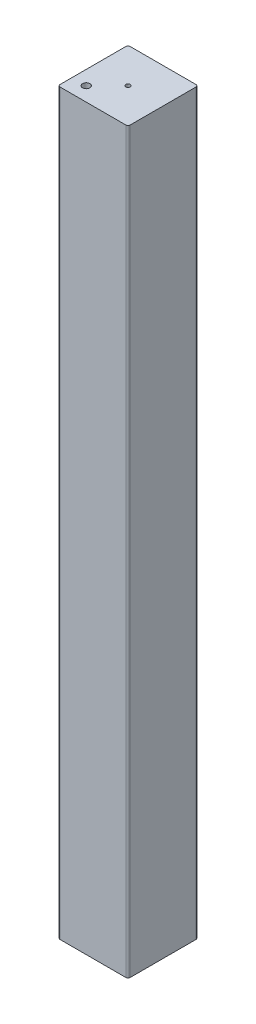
ISO-10303-21;
HEADER;
FILE_DESCRIPTION(('STEP AP214'),'2;1');
FILE_NAME('part.step','',(''),(''),'','','');
FILE_SCHEMA(('AUTOMOTIVE_DESIGN { 1 0 10303 214 1 1 1 1 }'));
ENDSEC;
DATA;
#1=APPLICATION_CONTEXT('core data for automotive mechanical design processes');
#2=APPLICATION_PROTOCOL_DEFINITION('international standard','automotive_design',2000,#1);
#3=PRODUCT_CONTEXT('',#1,'mechanical');
#4=PRODUCT('Part','Part','',(#3));
#5=PRODUCT_RELATED_PRODUCT_CATEGORY('part','',(#4));
#6=PRODUCT_DEFINITION_FORMATION('','',#4);
#7=PRODUCT_DEFINITION_CONTEXT('part definition',#1,'design');
#8=PRODUCT_DEFINITION('design','',#6,#7);
#9=PRODUCT_DEFINITION_SHAPE('','',#8);
#10=(LENGTH_UNIT() NAMED_UNIT(*) SI_UNIT(.MILLI.,.METRE.));
#11=(NAMED_UNIT(*) PLANE_ANGLE_UNIT() SI_UNIT($,.RADIAN.));
#12=(NAMED_UNIT(*) SI_UNIT($,.STERADIAN.) SOLID_ANGLE_UNIT());
#13=UNCERTAINTY_MEASURE_WITH_UNIT(LENGTH_MEASURE(1.E-05),#10,'distance_accuracy_value','');
#14=(GEOMETRIC_REPRESENTATION_CONTEXT(3) GLOBAL_UNCERTAINTY_ASSIGNED_CONTEXT((#13)) GLOBAL_UNIT_ASSIGNED_CONTEXT((#10,
#11,#12)) REPRESENTATION_CONTEXT('',''));
#15=CARTESIAN_POINT('',(0.,0.,0.));
#16=DIRECTION('',(0.,0.,1.));
#17=DIRECTION('',(1.,0.,0.));
#18=AXIS2_PLACEMENT_3D('',#15,#16,#17);
#19=CARTESIAN_POINT('',(47.5,1000.,-47.5));
#20=DIRECTION('',(0.,-1.,0.));
#21=DIRECTION('',(0.,0.,-1.));
#22=AXIS2_PLACEMENT_3D('',#19,#20,#21);
#23=PLANE('',#22);
#24=CARTESIAN_POINT('',(0.,1000.,0.));
#25=DIRECTION('',(0.,-1.,0.));
#26=DIRECTION('',(0.,0.,-1.));
#27=AXIS2_PLACEMENT_3D('',#24,#25,#26);
#28=CIRCLE('',#27,3.);
#29=CARTESIAN_POINT('',(0.,1000.,-3.));
#30=VERTEX_POINT('',#29);
#31=EDGE_CURVE('E255',#30,#30,#28,.T.);
#32=ORIENTED_EDGE('',*,*,#31,.T.);
#33=EDGE_LOOP('',(#32));
#34=FACE_BOUND('',#33,.T.);
#35=DIRECTION('',(0.,0.,-1.));
#36=VECTOR('',#35,1.);
#37=CARTESIAN_POINT('',(47.5,1000.,-47.5));
#38=LINE('',#37,#36);
#39=CARTESIAN_POINT('',(47.5,1000.,44.5));
#40=VERTEX_POINT('',#39);
#41=CARTESIAN_POINT('',(47.5,1000.,-44.5));
#42=VERTEX_POINT('',#41);
#43=EDGE_CURVE('E129',#40,#42,#38,.T.);
#44=ORIENTED_EDGE('',*,*,#43,.T.);
#45=CARTESIAN_POINT('',(44.5,1000.,-44.5));
#46=DIRECTION('',(0.,-1.,0.));
#47=DIRECTION('',(0.,0.,-1.));
#48=AXIS2_PLACEMENT_3D('',#45,#46,#47);
#49=CIRCLE('',#48,3.);
#50=CARTESIAN_POINT('',(44.5,1000.,-47.5));
#51=VERTEX_POINT('',#50);
#52=EDGE_CURVE('E150',#42,#51,#49,.F.);
#53=ORIENTED_EDGE('',*,*,#52,.T.);
#54=DIRECTION('',(-1.,0.,0.));
#55=VECTOR('',#54,1.);
#56=CARTESIAN_POINT('',(47.5,1000.,-47.5));
#57=LINE('',#56,#55);
#58=CARTESIAN_POINT('',(-44.5,1000.,-47.5));
#59=VERTEX_POINT('',#58);
#60=EDGE_CURVE('E112',#51,#59,#57,.T.);
#61=ORIENTED_EDGE('',*,*,#60,.T.);
#62=CARTESIAN_POINT('',(-44.5,1000.,-44.5));
#63=DIRECTION('',(0.,-1.,0.));
#64=DIRECTION('',(0.,0.,-1.));
#65=AXIS2_PLACEMENT_3D('',#62,#63,#64);
#66=CIRCLE('',#65,3.);
#67=CARTESIAN_POINT('',(-47.5,1000.,-44.5));
#68=VERTEX_POINT('',#67);
#69=EDGE_CURVE('E145',#59,#68,#66,.F.);
#70=ORIENTED_EDGE('',*,*,#69,.T.);
#71=DIRECTION('',(0.,0.,1.));
#72=VECTOR('',#71,1.);
#73=CARTESIAN_POINT('',(-47.5,1000.,-47.5));
#74=LINE('',#73,#72);
#75=CARTESIAN_POINT('',(-47.5,1000.,44.5));
#76=VERTEX_POINT('',#75);
#77=EDGE_CURVE('E133',#68,#76,#74,.T.);
#78=ORIENTED_EDGE('',*,*,#77,.T.);
#79=CARTESIAN_POINT('',(-44.5,1000.,44.5));
#80=DIRECTION('',(0.,-1.,0.));
#81=DIRECTION('',(0.,0.,-1.));
#82=AXIS2_PLACEMENT_3D('',#79,#80,#81);
#83=CIRCLE('',#82,3.);
#84=CARTESIAN_POINT('',(-44.5,1000.,47.5));
#85=VERTEX_POINT('',#84);
#86=EDGE_CURVE('E48',#76,#85,#83,.F.);
#87=ORIENTED_EDGE('',*,*,#86,.T.);
#88=DIRECTION('',(1.,0.,0.));
#89=VECTOR('',#88,1.);
#90=CARTESIAN_POINT('',(47.5,1000.,47.5));
#91=LINE('',#90,#89);
#92=CARTESIAN_POINT('',(44.5,1000.,47.5));
#93=VERTEX_POINT('',#92);
#94=EDGE_CURVE('E135',#85,#93,#91,.T.);
#95=ORIENTED_EDGE('',*,*,#94,.T.);
#96=CARTESIAN_POINT('',(44.5,1000.,44.5));
#97=DIRECTION('',(0.,-1.,0.));
#98=DIRECTION('',(0.,0.,-1.));
#99=AXIS2_PLACEMENT_3D('',#96,#97,#98);
#100=CIRCLE('',#99,3.);
#101=EDGE_CURVE('E148',#93,#40,#100,.F.);
#102=ORIENTED_EDGE('',*,*,#101,.T.);
#103=EDGE_LOOP('',(#44,#53,#61,#70,#78,#87,#95,#102));
#104=FACE_BOUND('',#103,.T.);
#105=CARTESIAN_POINT('',(-28.2842712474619,1000.,28.2842712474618));
#106=DIRECTION('',(0.,-1.,0.));
#107=DIRECTION('',(0.,0.,-1.));
#108=AXIS2_PLACEMENT_3D('',#105,#106,#107);
#109=CIRCLE('',#108,5.);
#110=CARTESIAN_POINT('',(-28.2842712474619,1000.,23.2842712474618));
#111=VERTEX_POINT('',#110);
#112=EDGE_CURVE('E259',#111,#111,#109,.T.);
#113=ORIENTED_EDGE('',*,*,#112,.T.);
#114=EDGE_LOOP('',(#113));
#115=FACE_BOUND('',#114,.T.);
#116=ADVANCED_FACE('F26',(#34,#104,#115),#23,.F.);
#117=CARTESIAN_POINT('',(47.5,1000.,-47.5));
#118=DIRECTION('',(-1.,0.,0.));
#119=DIRECTION('',(0.,0.,1.));
#120=AXIS2_PLACEMENT_3D('',#117,#118,#119);
#121=PLANE('',#120);
#122=DIRECTION('',(0.,0.,-1.));
#123=VECTOR('',#122,1.);
#124=CARTESIAN_POINT('',(47.5,0.,-47.5));
#125=LINE('',#124,#123);
#126=CARTESIAN_POINT('',(47.5,0.,44.5));
#127=VERTEX_POINT('',#126);
#128=CARTESIAN_POINT('',(47.5,0.,-44.5));
#129=VERTEX_POINT('',#128);
#130=EDGE_CURVE('E119',#127,#129,#125,.T.);
#131=ORIENTED_EDGE('',*,*,#130,.T.);
#132=DIRECTION('',(0.,-1.,0.));
#133=VECTOR('',#132,1.);
#134=CARTESIAN_POINT('',(47.5,1000.,-44.5));
#135=LINE('',#134,#133);
#136=EDGE_CURVE('E97',#129,#42,#135,.F.);
#137=ORIENTED_EDGE('',*,*,#136,.T.);
#138=ORIENTED_EDGE('',*,*,#43,.F.);
#139=DIRECTION('',(0.,-1.,0.));
#140=VECTOR('',#139,1.);
#141=CARTESIAN_POINT('',(47.5,1000.,44.5));
#142=LINE('',#141,#140);
#143=EDGE_CURVE('E102',#40,#127,#142,.T.);
#144=ORIENTED_EDGE('',*,*,#143,.T.);
#145=EDGE_LOOP('',(#131,#137,#138,#144));
#146=FACE_BOUND('',#145,.T.);
#147=ADVANCED_FACE('F28',(#146),#121,.F.);
#148=CARTESIAN_POINT('',(47.5,1000.,-47.5));
#149=DIRECTION('',(0.,0.,1.));
#150=DIRECTION('',(1.,0.,0.));
#151=AXIS2_PLACEMENT_3D('',#148,#149,#150);
#152=PLANE('',#151);
#153=ORIENTED_EDGE('',*,*,#60,.F.);
#154=DIRECTION('',(0.,-1.,0.));
#155=VECTOR('',#154,1.);
#156=CARTESIAN_POINT('',(44.5,1000.,-47.5));
#157=LINE('',#156,#155);
#158=CARTESIAN_POINT('',(44.5,0.,-47.5));
#159=VERTEX_POINT('',#158);
#160=EDGE_CURVE('E96',#51,#159,#157,.T.);
#161=ORIENTED_EDGE('',*,*,#160,.T.);
#162=DIRECTION('',(-1.,0.,0.));
#163=VECTOR('',#162,1.);
#164=CARTESIAN_POINT('',(47.5,0.,-47.5));
#165=LINE('',#164,#163);
#166=CARTESIAN_POINT('',(-44.5,0.,-47.5));
#167=VERTEX_POINT('',#166);
#168=EDGE_CURVE('E109',#159,#167,#165,.T.);
#169=ORIENTED_EDGE('',*,*,#168,.T.);
#170=DIRECTION('',(0.,-1.,0.));
#171=VECTOR('',#170,1.);
#172=CARTESIAN_POINT('',(-44.5,1000.,-47.5));
#173=LINE('',#172,#171);
#174=EDGE_CURVE('E114',#167,#59,#173,.F.);
#175=ORIENTED_EDGE('',*,*,#174,.T.);
#176=EDGE_LOOP('',(#153,#161,#169,#175));
#177=FACE_BOUND('',#176,.T.);
#178=ADVANCED_FACE('F108',(#177),#152,.F.);
#179=CARTESIAN_POINT('',(-47.5,1000.,-47.5));
#180=DIRECTION('',(1.,0.,0.));
#181=DIRECTION('',(0.,0.,-1.));
#182=AXIS2_PLACEMENT_3D('',#179,#180,#181);
#183=PLANE('',#182);
#184=DIRECTION('',(0.,0.,1.));
#185=VECTOR('',#184,1.);
#186=CARTESIAN_POINT('',(-47.5,0.,-47.5));
#187=LINE('',#186,#185);
#188=CARTESIAN_POINT('',(-47.5,0.,-44.5));
#189=VERTEX_POINT('',#188);
#190=CARTESIAN_POINT('',(-47.5,0.,44.5));
#191=VERTEX_POINT('',#190);
#192=EDGE_CURVE('E118',#189,#191,#187,.T.);
#193=ORIENTED_EDGE('',*,*,#192,.T.);
#194=DIRECTION('',(0.,-1.,0.));
#195=VECTOR('',#194,1.);
#196=CARTESIAN_POINT('',(-47.5,1000.,44.5));
#197=LINE('',#196,#195);
#198=EDGE_CURVE('E11',#191,#76,#197,.F.);
#199=ORIENTED_EDGE('',*,*,#198,.T.);
#200=ORIENTED_EDGE('',*,*,#77,.F.);
#201=DIRECTION('',(0.,-1.,0.));
#202=VECTOR('',#201,1.);
#203=CARTESIAN_POINT('',(-47.5,1000.,-44.5));
#204=LINE('',#203,#202);
#205=EDGE_CURVE('E34',#68,#189,#204,.T.);
#206=ORIENTED_EDGE('',*,*,#205,.T.);
#207=EDGE_LOOP('',(#193,#199,#200,#206));
#208=FACE_BOUND('',#207,.T.);
#209=ADVANCED_FACE('F159',(#208),#183,.F.);
#210=CARTESIAN_POINT('',(47.5,1000.,47.5));
#211=DIRECTION('',(0.,0.,-1.));
#212=DIRECTION('',(-1.,0.,0.));
#213=AXIS2_PLACEMENT_3D('',#210,#211,#212);
#214=PLANE('',#213);
#215=DIRECTION('',(1.,0.,0.));
#216=VECTOR('',#215,1.);
#217=CARTESIAN_POINT('',(47.5,0.,47.5));
#218=LINE('',#217,#216);
#219=CARTESIAN_POINT('',(-44.5,0.,47.5));
#220=VERTEX_POINT('',#219);
#221=CARTESIAN_POINT('',(44.5,0.,47.5));
#222=VERTEX_POINT('',#221);
#223=EDGE_CURVE('E122',#220,#222,#218,.T.);
#224=ORIENTED_EDGE('',*,*,#223,.T.);
#225=DIRECTION('',(0.,-1.,0.));
#226=VECTOR('',#225,1.);
#227=CARTESIAN_POINT('',(44.5,1000.,47.5));
#228=LINE('',#227,#226);
#229=EDGE_CURVE('E41',#222,#93,#228,.F.);
#230=ORIENTED_EDGE('',*,*,#229,.T.);
#231=ORIENTED_EDGE('',*,*,#94,.F.);
#232=DIRECTION('',(0.,-1.,0.));
#233=VECTOR('',#232,1.);
#234=CARTESIAN_POINT('',(-44.5,1000.,47.5));
#235=LINE('',#234,#233);
#236=EDGE_CURVE('E152',#85,#220,#235,.T.);
#237=ORIENTED_EDGE('',*,*,#236,.T.);
#238=EDGE_LOOP('',(#224,#230,#231,#237));
#239=FACE_BOUND('',#238,.T.);
#240=ADVANCED_FACE('F167',(#239),#214,.F.);
#241=CARTESIAN_POINT('',(47.5,0.,-47.5));
#242=DIRECTION('',(0.,-1.,0.));
#243=DIRECTION('',(0.,0.,-1.));
#244=AXIS2_PLACEMENT_3D('',#241,#242,#243);
#245=PLANE('',#244);
#246=ORIENTED_EDGE('',*,*,#168,.F.);
#247=CARTESIAN_POINT('',(44.5,0.,-44.5));
#248=DIRECTION('',(0.,-1.,0.));
#249=DIRECTION('',(0.,0.,-1.));
#250=AXIS2_PLACEMENT_3D('',#247,#248,#249);
#251=CIRCLE('',#250,3.);
#252=EDGE_CURVE('E92',#159,#129,#251,.T.);
#253=ORIENTED_EDGE('',*,*,#252,.T.);
#254=ORIENTED_EDGE('',*,*,#130,.F.);
#255=CARTESIAN_POINT('',(44.5,0.,44.5));
#256=DIRECTION('',(0.,-1.,0.));
#257=DIRECTION('',(0.,0.,-1.));
#258=AXIS2_PLACEMENT_3D('',#255,#256,#257);
#259=CIRCLE('',#258,3.);
#260=EDGE_CURVE('E103',#127,#222,#259,.T.);
#261=ORIENTED_EDGE('',*,*,#260,.T.);
#262=ORIENTED_EDGE('',*,*,#223,.F.);
#263=CARTESIAN_POINT('',(-44.5,0.,44.5));
#264=DIRECTION('',(0.,-1.,0.));
#265=DIRECTION('',(0.,0.,-1.));
#266=AXIS2_PLACEMENT_3D('',#263,#264,#265);
#267=CIRCLE('',#266,3.);
#268=EDGE_CURVE('E139',#220,#191,#267,.T.);
#269=ORIENTED_EDGE('',*,*,#268,.T.);
#270=ORIENTED_EDGE('',*,*,#192,.F.);
#271=CARTESIAN_POINT('',(-44.5,0.,-44.5));
#272=DIRECTION('',(0.,-1.,0.));
#273=DIRECTION('',(0.,0.,-1.));
#274=AXIS2_PLACEMENT_3D('',#271,#272,#273);
#275=CIRCLE('',#274,3.);
#276=EDGE_CURVE('E113',#189,#167,#275,.T.);
#277=ORIENTED_EDGE('',*,*,#276,.T.);
#278=EDGE_LOOP('',(#246,#253,#254,#261,#262,#269,#270,#277));
#279=FACE_BOUND('',#278,.T.);
#280=ADVANCED_FACE('F116',(#279),#245,.T.);
#281=CARTESIAN_POINT('',(0.,975.,0.));
#282=DIRECTION('',(0.,1.,0.));
#283=DIRECTION('',(0.,0.,1.));
#284=AXIS2_PLACEMENT_3D('',#281,#282,#283);
#285=CYLINDRICAL_SURFACE('',#284,3.);
#286=CARTESIAN_POINT('',(0.,975.,0.));
#287=DIRECTION('',(0.,-1.,0.));
#288=DIRECTION('',(0.,0.,-1.));
#289=AXIS2_PLACEMENT_3D('',#286,#287,#288);
#290=CIRCLE('',#289,3.);
#291=CARTESIAN_POINT('',(0.,975.,-3.));
#292=VERTEX_POINT('',#291);
#293=EDGE_CURVE('E124',#292,#292,#290,.T.);
#294=ORIENTED_EDGE('',*,*,#293,.T.);
#295=EDGE_LOOP('',(#294));
#296=FACE_BOUND('',#295,.T.);
#297=ORIENTED_EDGE('',*,*,#31,.F.);
#298=EDGE_LOOP('',(#297));
#299=FACE_BOUND('',#298,.T.);
#300=ADVANCED_FACE('F215',(#296,#299),#285,.F.);
#301=CARTESIAN_POINT('',(0.,975.,0.));
#302=DIRECTION('',(0.,-1.,0.));
#303=DIRECTION('',(0.,0.,-1.));
#304=AXIS2_PLACEMENT_3D('',#301,#302,#303);
#305=PLANE('',#304);
#306=ORIENTED_EDGE('',*,*,#293,.F.);
#307=EDGE_LOOP('',(#306));
#308=FACE_BOUND('',#307,.T.);
#309=ADVANCED_FACE('F244',(#308),#305,.F.);
#310=CARTESIAN_POINT('',(-28.2842712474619,985.,28.2842712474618));
#311=DIRECTION('',(0.,1.,0.));
#312=DIRECTION('',(0.,0.,1.));
#313=AXIS2_PLACEMENT_3D('',#310,#311,#312);
#314=CYLINDRICAL_SURFACE('',#313,5.);
#315=CARTESIAN_POINT('',(-28.2842712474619,985.,28.2842712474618));
#316=DIRECTION('',(0.,-1.,0.));
#317=DIRECTION('',(0.,0.,-1.));
#318=AXIS2_PLACEMENT_3D('',#315,#316,#317);
#319=CIRCLE('',#318,5.);
#320=CARTESIAN_POINT('',(-28.2842712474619,985.,23.2842712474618));
#321=VERTEX_POINT('',#320);
#322=EDGE_CURVE('E256',#321,#321,#319,.T.);
#323=ORIENTED_EDGE('',*,*,#322,.T.);
#324=EDGE_LOOP('',(#323));
#325=FACE_BOUND('',#324,.T.);
#326=ORIENTED_EDGE('',*,*,#112,.F.);
#327=EDGE_LOOP('',(#326));
#328=FACE_BOUND('',#327,.T.);
#329=ADVANCED_FACE('F240',(#325,#328),#314,.F.);
#330=CARTESIAN_POINT('',(-28.2842712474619,985.,28.2842712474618));
#331=DIRECTION('',(0.,-1.,0.));
#332=DIRECTION('',(0.,0.,-1.));
#333=AXIS2_PLACEMENT_3D('',#330,#331,#332);
#334=PLANE('',#333);
#335=ORIENTED_EDGE('',*,*,#322,.F.);
#336=EDGE_LOOP('',(#335));
#337=FACE_BOUND('',#336,.T.);
#338=ADVANCED_FACE('F222',(#337),#334,.F.);
#339=CARTESIAN_POINT('',(44.5,1000.,-44.5));
#340=DIRECTION('',(0.,-1.,0.));
#341=DIRECTION('',(0.,0.,-1.));
#342=AXIS2_PLACEMENT_3D('',#339,#340,#341);
#343=CYLINDRICAL_SURFACE('',#342,3.);
#344=ORIENTED_EDGE('',*,*,#52,.F.);
#345=ORIENTED_EDGE('',*,*,#136,.F.);
#346=ORIENTED_EDGE('',*,*,#252,.F.);
#347=ORIENTED_EDGE('',*,*,#160,.F.);
#348=EDGE_LOOP('',(#344,#345,#346,#347));
#349=FACE_BOUND('',#348,.T.);
#350=ADVANCED_FACE('F95',(#349),#343,.T.);
#351=CARTESIAN_POINT('',(44.5,1000.,44.5));
#352=DIRECTION('',(0.,-1.,0.));
#353=DIRECTION('',(0.,0.,-1.));
#354=AXIS2_PLACEMENT_3D('',#351,#352,#353);
#355=CYLINDRICAL_SURFACE('',#354,3.);
#356=ORIENTED_EDGE('',*,*,#101,.F.);
#357=ORIENTED_EDGE('',*,*,#229,.F.);
#358=ORIENTED_EDGE('',*,*,#260,.F.);
#359=ORIENTED_EDGE('',*,*,#143,.F.);
#360=EDGE_LOOP('',(#356,#357,#358,#359));
#361=FACE_BOUND('',#360,.T.);
#362=ADVANCED_FACE('F173',(#361),#355,.T.);
#363=CARTESIAN_POINT('',(-44.5,1000.,44.5));
#364=DIRECTION('',(0.,-1.,0.));
#365=DIRECTION('',(0.,0.,-1.));
#366=AXIS2_PLACEMENT_3D('',#363,#364,#365);
#367=CYLINDRICAL_SURFACE('',#366,3.);
#368=ORIENTED_EDGE('',*,*,#86,.F.);
#369=ORIENTED_EDGE('',*,*,#198,.F.);
#370=ORIENTED_EDGE('',*,*,#268,.F.);
#371=ORIENTED_EDGE('',*,*,#236,.F.);
#372=EDGE_LOOP('',(#368,#369,#370,#371));
#373=FACE_BOUND('',#372,.T.);
#374=ADVANCED_FACE('F166',(#373),#367,.T.);
#375=CARTESIAN_POINT('',(-44.5,1000.,-44.5));
#376=DIRECTION('',(0.,-1.,0.));
#377=DIRECTION('',(0.,0.,-1.));
#378=AXIS2_PLACEMENT_3D('',#375,#376,#377);
#379=CYLINDRICAL_SURFACE('',#378,3.);
#380=ORIENTED_EDGE('',*,*,#69,.F.);
#381=ORIENTED_EDGE('',*,*,#174,.F.);
#382=ORIENTED_EDGE('',*,*,#276,.F.);
#383=ORIENTED_EDGE('',*,*,#205,.F.);
#384=EDGE_LOOP('',(#380,#381,#382,#383));
#385=FACE_BOUND('',#384,.T.);
#386=ADVANCED_FACE('F175',(#385),#379,.T.);
#387=CLOSED_SHELL('',(#116,#147,#178,#209,#240,#280,#300,#309,#329,#338,#350,#362,#374,#386));
#388=MANIFOLD_SOLID_BREP('B2',#387);
#389=ADVANCED_BREP_SHAPE_REPRESENTATION('',(#18,#388),#14);
#390=SHAPE_DEFINITION_REPRESENTATION(#9,#389);
ENDSEC;
END-ISO-10303-21;
